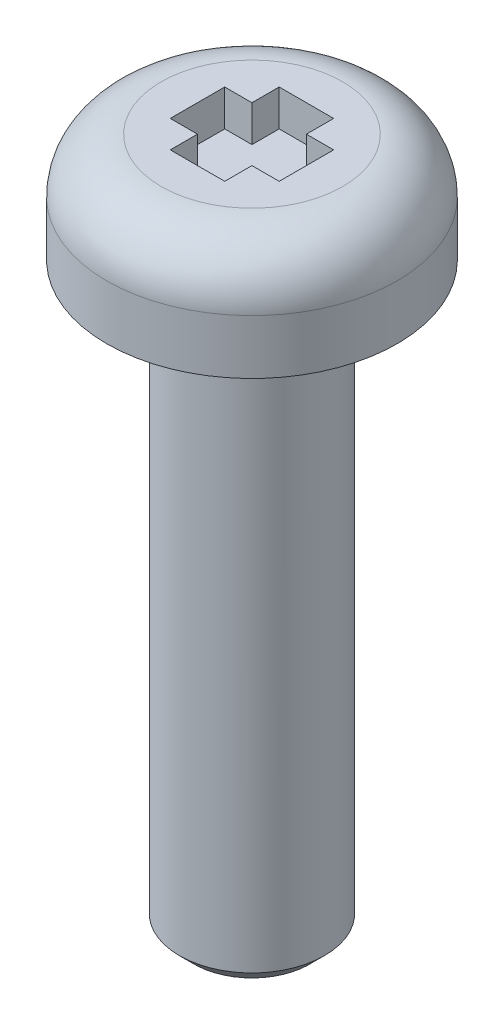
ISO-10303-21;
HEADER;
FILE_DESCRIPTION(('STEP AP214'),'2;1');
FILE_NAME('part.step','',(''),(''),'','','');
FILE_SCHEMA(('AUTOMOTIVE_DESIGN { 1 0 10303 214 1 1 1 1 }'));
ENDSEC;
DATA;
#1=APPLICATION_CONTEXT('core data for automotive mechanical design processes');
#2=APPLICATION_PROTOCOL_DEFINITION('international standard','automotive_design',2000,#1);
#3=PRODUCT_CONTEXT('',#1,'mechanical');
#4=PRODUCT('Part','Part','',(#3));
#5=PRODUCT_RELATED_PRODUCT_CATEGORY('part','',(#4));
#6=PRODUCT_DEFINITION_FORMATION('','',#4);
#7=PRODUCT_DEFINITION_CONTEXT('part definition',#1,'design');
#8=PRODUCT_DEFINITION('design','',#6,#7);
#9=PRODUCT_DEFINITION_SHAPE('','',#8);
#10=(LENGTH_UNIT() NAMED_UNIT(*) SI_UNIT(.MILLI.,.METRE.));
#11=(NAMED_UNIT(*) PLANE_ANGLE_UNIT() SI_UNIT($,.RADIAN.));
#12=(NAMED_UNIT(*) SI_UNIT($,.STERADIAN.) SOLID_ANGLE_UNIT());
#13=UNCERTAINTY_MEASURE_WITH_UNIT(LENGTH_MEASURE(1.E-05),#10,'distance_accuracy_value','');
#14=(GEOMETRIC_REPRESENTATION_CONTEXT(3) GLOBAL_UNCERTAINTY_ASSIGNED_CONTEXT((#13)) GLOBAL_UNIT_ASSIGNED_CONTEXT((#10,
#11,#12)) REPRESENTATION_CONTEXT('',''));
#15=CARTESIAN_POINT('',(0.,0.,0.));
#16=DIRECTION('',(0.,0.,1.));
#17=DIRECTION('',(1.,0.,0.));
#18=AXIS2_PLACEMENT_3D('',#15,#16,#17);
#19=CARTESIAN_POINT('',(4.,0.,0.));
#20=DIRECTION('',(0.,1.,0.));
#21=DIRECTION('',(0.,0.,1.));
#22=AXIS2_PLACEMENT_3D('',#19,#20,#21);
#23=PLANE('',#22);
#24=CARTESIAN_POINT('',(0.,0.,0.));
#25=DIRECTION('',(0.,1.,0.));
#26=DIRECTION('',(0.,0.,1.));
#27=AXIS2_PLACEMENT_3D('',#24,#25,#26);
#28=CIRCLE('',#27,2.4572);
#29=CARTESIAN_POINT('',(0.,0.,2.4572));
#30=VERTEX_POINT('',#29);
#31=EDGE_CURVE('E209',#30,#30,#28,.T.);
#32=ORIENTED_EDGE('',*,*,#31,.T.);
#33=EDGE_LOOP('',(#32));
#34=FACE_BOUND('',#33,.T.);
#35=CARTESIAN_POINT('',(0.,0.,0.));
#36=DIRECTION('',(0.,1.,0.));
#37=DIRECTION('',(0.,0.,1.));
#38=AXIS2_PLACEMENT_3D('',#35,#36,#37);
#39=CIRCLE('',#38,4.);
#40=CARTESIAN_POINT('',(0.,0.,4.));
#41=VERTEX_POINT('',#40);
#42=EDGE_CURVE('E203',#41,#41,#39,.T.);
#43=ORIENTED_EDGE('',*,*,#42,.F.);
#44=EDGE_LOOP('',(#43));
#45=FACE_BOUND('',#44,.T.);
#46=ADVANCED_FACE('F31',(#34,#45),#23,.F.);
#47=CARTESIAN_POINT('',(0.750000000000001,2.,1.5));
#48=DIRECTION('',(1.,0.,0.));
#49=DIRECTION('',(0.,0.,-1.));
#50=AXIS2_PLACEMENT_3D('',#47,#48,#49);
#51=PLANE('',#50);
#52=DIRECTION('',(0.,1.,0.));
#53=VECTOR('',#52,1.);
#54=CARTESIAN_POINT('',(0.75,2.,0.749999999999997));
#55=LINE('',#54,#53);
#56=CARTESIAN_POINT('',(0.750000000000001,2.,0.749999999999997));
#57=VERTEX_POINT('',#56);
#58=CARTESIAN_POINT('',(0.75,3.,0.749999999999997));
#59=VERTEX_POINT('',#58);
#60=EDGE_CURVE('E153',#57,#59,#55,.T.);
#61=ORIENTED_EDGE('',*,*,#60,.F.);
#62=DIRECTION('',(0.,0.,-1.));
#63=VECTOR('',#62,1.);
#64=CARTESIAN_POINT('',(0.750000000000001,2.,1.5));
#65=LINE('',#64,#63);
#66=CARTESIAN_POINT('',(0.750000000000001,2.,1.5));
#67=VERTEX_POINT('',#66);
#68=EDGE_CURVE('E162',#67,#57,#65,.T.);
#69=ORIENTED_EDGE('',*,*,#68,.F.);
#70=DIRECTION('',(0.,1.,0.));
#71=VECTOR('',#70,1.);
#72=CARTESIAN_POINT('',(0.750000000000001,2.,1.5));
#73=LINE('',#72,#71);
#74=CARTESIAN_POINT('',(0.750000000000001,3.,1.5));
#75=VERTEX_POINT('',#74);
#76=EDGE_CURVE('E188',#67,#75,#73,.T.);
#77=ORIENTED_EDGE('',*,*,#76,.T.);
#78=DIRECTION('',(0.,0.,-1.));
#79=VECTOR('',#78,1.);
#80=CARTESIAN_POINT('',(0.750000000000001,3.,1.5));
#81=LINE('',#80,#79);
#82=EDGE_CURVE('E175',#75,#59,#81,.T.);
#83=ORIENTED_EDGE('',*,*,#82,.T.);
#84=EDGE_LOOP('',(#61,#69,#77,#83));
#85=FACE_BOUND('',#84,.T.);
#86=ADVANCED_FACE('F225',(#85),#51,.F.);
#87=CARTESIAN_POINT('',(-0.749999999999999,2.,1.5));
#88=DIRECTION('',(1.,0.,0.));
#89=DIRECTION('',(0.,0.,-1.));
#90=AXIS2_PLACEMENT_3D('',#87,#88,#89);
#91=PLANE('',#90);
#92=DIRECTION('',(0.,0.,-1.));
#93=VECTOR('',#92,1.);
#94=CARTESIAN_POINT('',(-0.749999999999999,2.,1.5));
#95=LINE('',#94,#93);
#96=CARTESIAN_POINT('',(-0.749999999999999,2.,1.5));
#97=VERTEX_POINT('',#96);
#98=CARTESIAN_POINT('',(-0.75,2.,0.75));
#99=VERTEX_POINT('',#98);
#100=EDGE_CURVE('E169',#97,#99,#95,.T.);
#101=ORIENTED_EDGE('',*,*,#100,.T.);
#102=DIRECTION('',(0.,1.,0.));
#103=VECTOR('',#102,1.);
#104=CARTESIAN_POINT('',(-0.75,2.,0.750000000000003));
#105=LINE('',#104,#103);
#106=CARTESIAN_POINT('',(-0.75,3.,0.750000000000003));
#107=VERTEX_POINT('',#106);
#108=EDGE_CURVE('E150',#99,#107,#105,.T.);
#109=ORIENTED_EDGE('',*,*,#108,.T.);
#110=DIRECTION('',(0.,0.,-1.));
#111=VECTOR('',#110,1.);
#112=CARTESIAN_POINT('',(-0.749999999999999,3.,1.5));
#113=LINE('',#112,#111);
#114=CARTESIAN_POINT('',(-0.749999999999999,3.,1.5));
#115=VERTEX_POINT('',#114);
#116=EDGE_CURVE('E182',#115,#107,#113,.T.);
#117=ORIENTED_EDGE('',*,*,#116,.F.);
#118=DIRECTION('',(0.,1.,0.));
#119=VECTOR('',#118,1.);
#120=CARTESIAN_POINT('',(-0.749999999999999,2.,1.5));
#121=LINE('',#120,#119);
#122=EDGE_CURVE('E191',#97,#115,#121,.T.);
#123=ORIENTED_EDGE('',*,*,#122,.F.);
#124=EDGE_LOOP('',(#101,#109,#117,#123));
#125=FACE_BOUND('',#124,.T.);
#126=ADVANCED_FACE('F231',(#125),#91,.T.);
#127=CARTESIAN_POINT('',(0.,11.592517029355,0.));
#128=DIRECTION('',(0.,1.,0.));
#129=DIRECTION('',(0.,0.,1.));
#130=AXIS2_PLACEMENT_3D('',#127,#128,#129);
#131=CYLINDRICAL_SURFACE('',#130,4.);
#132=CARTESIAN_POINT('',(0.,1.5,0.));
#133=DIRECTION('',(0.,1.,0.));
#134=DIRECTION('',(0.,0.,1.));
#135=AXIS2_PLACEMENT_3D('',#132,#133,#134);
#136=CIRCLE('',#135,4.);
#137=CARTESIAN_POINT('',(0.,1.5,4.));
#138=VERTEX_POINT('',#137);
#139=EDGE_CURVE('E200',#138,#138,#136,.T.);
#140=ORIENTED_EDGE('',*,*,#139,.F.);
#141=EDGE_LOOP('',(#140));
#142=FACE_BOUND('',#141,.T.);
#143=ORIENTED_EDGE('',*,*,#42,.T.);
#144=EDGE_LOOP('',(#143));
#145=FACE_BOUND('',#144,.T.);
#146=ADVANCED_FACE('F237',(#142,#145),#131,.T.);
#147=CARTESIAN_POINT('',(0.,1.5,0.));
#148=DIRECTION('',(0.,1.,0.));
#149=DIRECTION('',(0.,0.,1.));
#150=AXIS2_PLACEMENT_3D('',#147,#148,#149);
#151=TOROIDAL_SURFACE('',#150,2.5,1.5);
#152=CARTESIAN_POINT('',(0.,3.,0.));
#153=DIRECTION('',(0.,1.,0.));
#154=DIRECTION('',(0.,0.,1.));
#155=AXIS2_PLACEMENT_3D('',#152,#153,#154);
#156=CIRCLE('',#155,2.5);
#157=CARTESIAN_POINT('',(0.,3.,2.5));
#158=VERTEX_POINT('',#157);
#159=EDGE_CURVE('E190',#158,#158,#156,.T.);
#160=ORIENTED_EDGE('',*,*,#159,.F.);
#161=EDGE_LOOP('',(#160));
#162=FACE_BOUND('',#161,.T.);
#163=ORIENTED_EDGE('',*,*,#139,.T.);
#164=EDGE_LOOP('',(#163));
#165=FACE_BOUND('',#164,.T.);
#166=ADVANCED_FACE('F240',(#162,#165),#151,.T.);
#167=CARTESIAN_POINT('',(0.,3.,0.));
#168=DIRECTION('',(0.,-1.,0.));
#169=DIRECTION('',(0.,0.,-1.));
#170=AXIS2_PLACEMENT_3D('',#167,#168,#169);
#171=PLANE('',#170);
#172=CARTESIAN_POINT('',(0.75,3.,-0.750000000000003));
#173=VERTEX_POINT('',#172);
#174=CARTESIAN_POINT('',(0.75,3.,-1.5));
#175=VERTEX_POINT('',#174);
#176=EDGE_CURVE('E161',#173,#175,#81,.T.);
#177=ORIENTED_EDGE('',*,*,#176,.F.);
#178=DIRECTION('',(-1.,0.,0.));
#179=VECTOR('',#178,1.);
#180=CARTESIAN_POINT('',(1.5,3.,-0.750000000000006));
#181=LINE('',#180,#179);
#182=CARTESIAN_POINT('',(1.5,3.,-0.750000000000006));
#183=VERTEX_POINT('',#182);
#184=EDGE_CURVE('E438',#183,#173,#181,.T.);
#185=ORIENTED_EDGE('',*,*,#184,.F.);
#186=DIRECTION('',(0.,0.,1.));
#187=VECTOR('',#186,1.);
#188=CARTESIAN_POINT('',(1.5,3.,-0.750000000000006));
#189=LINE('',#188,#187);
#190=CARTESIAN_POINT('',(1.5,3.,0.749999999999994));
#191=VERTEX_POINT('',#190);
#192=EDGE_CURVE('E128',#183,#191,#189,.T.);
#193=ORIENTED_EDGE('',*,*,#192,.T.);
#194=DIRECTION('',(-1.,0.,0.));
#195=VECTOR('',#194,1.);
#196=CARTESIAN_POINT('',(1.5,3.,0.749999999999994));
#197=LINE('',#196,#195);
#198=EDGE_CURVE('E423',#191,#59,#197,.T.);
#199=ORIENTED_EDGE('',*,*,#198,.T.);
#200=ORIENTED_EDGE('',*,*,#82,.F.);
#201=DIRECTION('',(-1.,0.,0.));
#202=VECTOR('',#201,1.);
#203=CARTESIAN_POINT('',(0.750000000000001,3.,1.5));
#204=LINE('',#203,#202);
#205=EDGE_CURVE('E185',#75,#115,#204,.T.);
#206=ORIENTED_EDGE('',*,*,#205,.T.);
#207=ORIENTED_EDGE('',*,*,#116,.T.);
#208=CARTESIAN_POINT('',(-1.5,3.,0.750000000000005));
#209=VERTEX_POINT('',#208);
#210=EDGE_CURVE('E429',#107,#209,#197,.T.);
#211=ORIENTED_EDGE('',*,*,#210,.T.);
#212=DIRECTION('',(0.,0.,-1.));
#213=VECTOR('',#212,1.);
#214=CARTESIAN_POINT('',(-1.5,3.,0.750000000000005));
#215=LINE('',#214,#213);
#216=CARTESIAN_POINT('',(-1.5,3.,-0.749999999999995));
#217=VERTEX_POINT('',#216);
#218=EDGE_CURVE('E433',#209,#217,#215,.T.);
#219=ORIENTED_EDGE('',*,*,#218,.T.);
#220=CARTESIAN_POINT('',(-0.75,3.,-0.749999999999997));
#221=VERTEX_POINT('',#220);
#222=EDGE_CURVE('E141',#221,#217,#181,.T.);
#223=ORIENTED_EDGE('',*,*,#222,.F.);
#224=CARTESIAN_POINT('',(-0.75,3.,-1.5));
#225=VERTEX_POINT('',#224);
#226=EDGE_CURVE('E181',#221,#225,#113,.T.);
#227=ORIENTED_EDGE('',*,*,#226,.T.);
#228=DIRECTION('',(1.,0.,0.));
#229=VECTOR('',#228,1.);
#230=CARTESIAN_POINT('',(-0.75,3.,-1.5));
#231=LINE('',#230,#229);
#232=EDGE_CURVE('E178',#225,#175,#231,.T.);
#233=ORIENTED_EDGE('',*,*,#232,.T.);
#234=EDGE_LOOP('',(#177,#185,#193,#199,#200,#206,#207,#211,#219,#223,#227,#233));
#235=FACE_BOUND('',#234,.T.);
#236=ORIENTED_EDGE('',*,*,#159,.T.);
#237=EDGE_LOOP('',(#236));
#238=FACE_BOUND('',#237,.T.);
#239=ADVANCED_FACE('F244',(#235,#238),#171,.F.);
#240=CARTESIAN_POINT('',(0.75,2.,-0.75));
#241=VERTEX_POINT('',#240);
#242=CARTESIAN_POINT('',(0.75,2.,-1.5));
#243=VERTEX_POINT('',#242);
#244=EDGE_CURVE('E166',#241,#243,#65,.T.);
#245=ORIENTED_EDGE('',*,*,#244,.F.);
#246=DIRECTION('',(0.,1.,0.));
#247=VECTOR('',#246,1.);
#248=CARTESIAN_POINT('',(0.75,2.,-0.750000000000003));
#249=LINE('',#248,#247);
#250=EDGE_CURVE('E158',#241,#173,#249,.T.);
#251=ORIENTED_EDGE('',*,*,#250,.T.);
#252=ORIENTED_EDGE('',*,*,#176,.T.);
#253=DIRECTION('',(0.,1.,0.));
#254=VECTOR('',#253,1.);
#255=CARTESIAN_POINT('',(0.75,2.,-1.5));
#256=LINE('',#255,#254);
#257=EDGE_CURVE('E174',#243,#175,#256,.T.);
#258=ORIENTED_EDGE('',*,*,#257,.F.);
#259=EDGE_LOOP('',(#245,#251,#252,#258));
#260=FACE_BOUND('',#259,.T.);
#261=ADVANCED_FACE('F234',(#260),#51,.F.);
#262=CARTESIAN_POINT('',(0.750000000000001,2.,1.5));
#263=DIRECTION('',(0.,0.,-1.));
#264=DIRECTION('',(-1.,0.,0.));
#265=AXIS2_PLACEMENT_3D('',#262,#263,#264);
#266=PLANE('',#265);
#267=ORIENTED_EDGE('',*,*,#205,.F.);
#268=ORIENTED_EDGE('',*,*,#76,.F.);
#269=DIRECTION('',(-1.,0.,0.));
#270=VECTOR('',#269,1.);
#271=CARTESIAN_POINT('',(0.750000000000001,2.,1.5));
#272=LINE('',#271,#270);
#273=EDGE_CURVE('E172',#67,#97,#272,.T.);
#274=ORIENTED_EDGE('',*,*,#273,.T.);
#275=ORIENTED_EDGE('',*,*,#122,.T.);
#276=EDGE_LOOP('',(#267,#268,#274,#275));
#277=FACE_BOUND('',#276,.T.);
#278=ADVANCED_FACE('F250',(#277),#266,.T.);
#279=DIRECTION('',(0.,1.,0.));
#280=VECTOR('',#279,1.);
#281=CARTESIAN_POINT('',(-0.75,2.,-0.749999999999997));
#282=LINE('',#281,#280);
#283=CARTESIAN_POINT('',(-0.75,2.,-0.749999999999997));
#284=VERTEX_POINT('',#283);
#285=EDGE_CURVE('E156',#284,#221,#282,.T.);
#286=ORIENTED_EDGE('',*,*,#285,.F.);
#287=CARTESIAN_POINT('',(-0.75,2.,-1.5));
#288=VERTEX_POINT('',#287);
#289=EDGE_CURVE('E124',#284,#288,#95,.T.);
#290=ORIENTED_EDGE('',*,*,#289,.T.);
#291=DIRECTION('',(0.,1.,0.));
#292=VECTOR('',#291,1.);
#293=CARTESIAN_POINT('',(-0.75,2.,-1.5));
#294=LINE('',#293,#292);
#295=EDGE_CURVE('E193',#288,#225,#294,.T.);
#296=ORIENTED_EDGE('',*,*,#295,.T.);
#297=ORIENTED_EDGE('',*,*,#226,.F.);
#298=EDGE_LOOP('',(#286,#290,#296,#297));
#299=FACE_BOUND('',#298,.T.);
#300=ADVANCED_FACE('F255',(#299),#91,.T.);
#301=CARTESIAN_POINT('',(-0.75,2.,-1.5));
#302=DIRECTION('',(0.,0.,1.));
#303=DIRECTION('',(1.,0.,0.));
#304=AXIS2_PLACEMENT_3D('',#301,#302,#303);
#305=PLANE('',#304);
#306=ORIENTED_EDGE('',*,*,#232,.F.);
#307=ORIENTED_EDGE('',*,*,#295,.F.);
#308=DIRECTION('',(1.,0.,0.));
#309=VECTOR('',#308,1.);
#310=CARTESIAN_POINT('',(-0.75,2.,-1.5));
#311=LINE('',#310,#309);
#312=EDGE_CURVE('E165',#288,#243,#311,.T.);
#313=ORIENTED_EDGE('',*,*,#312,.T.);
#314=ORIENTED_EDGE('',*,*,#257,.T.);
#315=EDGE_LOOP('',(#306,#307,#313,#314));
#316=FACE_BOUND('',#315,.T.);
#317=ADVANCED_FACE('F252',(#316),#305,.T.);
#318=CARTESIAN_POINT('',(0.75,2.,-1.5));
#319=DIRECTION('',(0.,-1.,0.));
#320=DIRECTION('',(0.,0.,-1.));
#321=AXIS2_PLACEMENT_3D('',#318,#319,#320);
#322=PLANE('',#321);
#323=ORIENTED_EDGE('',*,*,#289,.F.);
#324=DIRECTION('',(-1.,0.,0.));
#325=VECTOR('',#324,1.);
#326=CARTESIAN_POINT('',(1.5,2.,-0.750000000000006));
#327=LINE('',#326,#325);
#328=CARTESIAN_POINT('',(-1.5,2.,-0.749999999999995));
#329=VERTEX_POINT('',#328);
#330=EDGE_CURVE('E119',#284,#329,#327,.T.);
#331=ORIENTED_EDGE('',*,*,#330,.T.);
#332=DIRECTION('',(0.,0.,-1.));
#333=VECTOR('',#332,1.);
#334=CARTESIAN_POINT('',(-1.5,2.,0.750000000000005));
#335=LINE('',#334,#333);
#336=CARTESIAN_POINT('',(-1.5,2.,0.750000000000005));
#337=VERTEX_POINT('',#336);
#338=EDGE_CURVE('E122',#337,#329,#335,.T.);
#339=ORIENTED_EDGE('',*,*,#338,.F.);
#340=DIRECTION('',(-1.,0.,0.));
#341=VECTOR('',#340,1.);
#342=CARTESIAN_POINT('',(1.5,2.,0.749999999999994));
#343=LINE('',#342,#341);
#344=EDGE_CURVE('E46',#99,#337,#343,.T.);
#345=ORIENTED_EDGE('',*,*,#344,.F.);
#346=ORIENTED_EDGE('',*,*,#100,.F.);
#347=ORIENTED_EDGE('',*,*,#273,.F.);
#348=ORIENTED_EDGE('',*,*,#68,.T.);
#349=CARTESIAN_POINT('',(1.5,2.,0.749999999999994));
#350=VERTEX_POINT('',#349);
#351=EDGE_CURVE('E146',#350,#57,#343,.T.);
#352=ORIENTED_EDGE('',*,*,#351,.F.);
#353=DIRECTION('',(0.,0.,1.));
#354=VECTOR('',#353,1.);
#355=CARTESIAN_POINT('',(1.5,2.,-0.750000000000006));
#356=LINE('',#355,#354);
#357=CARTESIAN_POINT('',(1.5,2.,-0.750000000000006));
#358=VERTEX_POINT('',#357);
#359=EDGE_CURVE('E142',#358,#350,#356,.T.);
#360=ORIENTED_EDGE('',*,*,#359,.F.);
#361=EDGE_CURVE('E53',#358,#241,#327,.T.);
#362=ORIENTED_EDGE('',*,*,#361,.T.);
#363=ORIENTED_EDGE('',*,*,#244,.T.);
#364=ORIENTED_EDGE('',*,*,#312,.F.);
#365=EDGE_LOOP('',(#323,#331,#339,#345,#346,#347,#348,#352,#360,#362,#363,#364));
#366=FACE_BOUND('',#365,.T.);
#367=ADVANCED_FACE('F121',(#366),#322,.F.);
#368=CARTESIAN_POINT('',(1.5,2.,0.749999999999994));
#369=DIRECTION('',(0.,0.,-1.));
#370=DIRECTION('',(-1.,0.,0.));
#371=AXIS2_PLACEMENT_3D('',#368,#369,#370);
#372=PLANE('',#371);
#373=ORIENTED_EDGE('',*,*,#344,.T.);
#374=DIRECTION('',(0.,1.,0.));
#375=VECTOR('',#374,1.);
#376=CARTESIAN_POINT('',(-1.5,2.,0.750000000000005));
#377=LINE('',#376,#375);
#378=EDGE_CURVE('E137',#337,#209,#377,.T.);
#379=ORIENTED_EDGE('',*,*,#378,.T.);
#380=ORIENTED_EDGE('',*,*,#210,.F.);
#381=ORIENTED_EDGE('',*,*,#108,.F.);
#382=EDGE_LOOP('',(#373,#379,#380,#381));
#383=FACE_BOUND('',#382,.T.);
#384=ADVANCED_FACE('F265',(#383),#372,.T.);
#385=CARTESIAN_POINT('',(1.5,2.,-0.750000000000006));
#386=DIRECTION('',(0.,0.,-1.));
#387=DIRECTION('',(-1.,0.,0.));
#388=AXIS2_PLACEMENT_3D('',#385,#386,#387);
#389=PLANE('',#388);
#390=ORIENTED_EDGE('',*,*,#285,.T.);
#391=ORIENTED_EDGE('',*,*,#222,.T.);
#392=DIRECTION('',(0.,1.,0.));
#393=VECTOR('',#392,1.);
#394=CARTESIAN_POINT('',(-1.5,2.,-0.749999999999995));
#395=LINE('',#394,#393);
#396=EDGE_CURVE('E135',#329,#217,#395,.T.);
#397=ORIENTED_EDGE('',*,*,#396,.F.);
#398=ORIENTED_EDGE('',*,*,#330,.F.);
#399=EDGE_LOOP('',(#390,#391,#397,#398));
#400=FACE_BOUND('',#399,.T.);
#401=ADVANCED_FACE('F139',(#400),#389,.F.);
#402=CARTESIAN_POINT('',(-1.5,2.,0.750000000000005));
#403=DIRECTION('',(1.,0.,0.));
#404=DIRECTION('',(0.,0.,-1.));
#405=AXIS2_PLACEMENT_3D('',#402,#403,#404);
#406=PLANE('',#405);
#407=ORIENTED_EDGE('',*,*,#218,.F.);
#408=ORIENTED_EDGE('',*,*,#378,.F.);
#409=ORIENTED_EDGE('',*,*,#338,.T.);
#410=ORIENTED_EDGE('',*,*,#396,.T.);
#411=EDGE_LOOP('',(#407,#408,#409,#410));
#412=FACE_BOUND('',#411,.T.);
#413=ADVANCED_FACE('F134',(#412),#406,.T.);
#414=ORIENTED_EDGE('',*,*,#361,.F.);
#415=DIRECTION('',(0.,1.,0.));
#416=VECTOR('',#415,1.);
#417=CARTESIAN_POINT('',(1.5,2.,-0.750000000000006));
#418=LINE('',#417,#416);
#419=EDGE_CURVE('E154',#358,#183,#418,.T.);
#420=ORIENTED_EDGE('',*,*,#419,.T.);
#421=ORIENTED_EDGE('',*,*,#184,.T.);
#422=ORIENTED_EDGE('',*,*,#250,.F.);
#423=EDGE_LOOP('',(#414,#420,#421,#422));
#424=FACE_BOUND('',#423,.T.);
#425=ADVANCED_FACE('F268',(#424),#389,.F.);
#426=ORIENTED_EDGE('',*,*,#60,.T.);
#427=ORIENTED_EDGE('',*,*,#198,.F.);
#428=DIRECTION('',(0.,1.,0.));
#429=VECTOR('',#428,1.);
#430=CARTESIAN_POINT('',(1.5,2.,0.749999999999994));
#431=LINE('',#430,#429);
#432=EDGE_CURVE('E144',#350,#191,#431,.T.);
#433=ORIENTED_EDGE('',*,*,#432,.F.);
#434=ORIENTED_EDGE('',*,*,#351,.T.);
#435=EDGE_LOOP('',(#426,#427,#433,#434));
#436=FACE_BOUND('',#435,.T.);
#437=ADVANCED_FACE('F274',(#436),#372,.T.);
#438=CARTESIAN_POINT('',(1.5,2.,-0.750000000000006));
#439=DIRECTION('',(-1.,0.,0.));
#440=DIRECTION('',(0.,0.,1.));
#441=AXIS2_PLACEMENT_3D('',#438,#439,#440);
#442=PLANE('',#441);
#443=ORIENTED_EDGE('',*,*,#192,.F.);
#444=ORIENTED_EDGE('',*,*,#419,.F.);
#445=ORIENTED_EDGE('',*,*,#359,.T.);
#446=ORIENTED_EDGE('',*,*,#432,.T.);
#447=EDGE_LOOP('',(#443,#444,#445,#446));
#448=FACE_BOUND('',#447,.T.);
#449=ADVANCED_FACE('F275',(#448),#442,.T.);
#450=CARTESIAN_POINT('',(0.,-16.,0.));
#451=DIRECTION('',(0.,1.,0.));
#452=DIRECTION('',(0.,0.,1.));
#453=AXIS2_PLACEMENT_3D('',#450,#451,#452);
#454=CYLINDRICAL_SURFACE('',#453,2.);
#455=CARTESIAN_POINT('',(0.,-15.5936,0.));
#456=DIRECTION('',(0.,-1.,0.));
#457=DIRECTION('',(0.,0.,-1.));
#458=AXIS2_PLACEMENT_3D('',#455,#456,#457);
#459=CIRCLE('',#458,2.);
#460=CARTESIAN_POINT('',(0.,-15.5936,-2.));
#461=VERTEX_POINT('',#460);
#462=EDGE_CURVE('E11',#461,#461,#459,.F.);
#463=ORIENTED_EDGE('',*,*,#462,.T.);
#464=EDGE_LOOP('',(#463));
#465=FACE_BOUND('',#464,.T.);
#466=CARTESIAN_POINT('',(0.,-0.4572,0.));
#467=DIRECTION('',(0.,1.,0.));
#468=DIRECTION('',(0.,0.,1.));
#469=AXIS2_PLACEMENT_3D('',#466,#467,#468);
#470=CIRCLE('',#469,2.);
#471=CARTESIAN_POINT('',(0.,-0.4572,2.));
#472=VERTEX_POINT('',#471);
#473=EDGE_CURVE('E206',#472,#472,#470,.F.);
#474=ORIENTED_EDGE('',*,*,#473,.T.);
#475=EDGE_LOOP('',(#474));
#476=FACE_BOUND('',#475,.T.);
#477=ADVANCED_FACE('F278',(#465,#476),#454,.T.);
#478=CARTESIAN_POINT('',(0.,-16.,0.));
#479=DIRECTION('',(0.,-1.,0.));
#480=DIRECTION('',(0.,0.,-1.));
#481=AXIS2_PLACEMENT_3D('',#478,#479,#480);
#482=PLANE('',#481);
#483=CARTESIAN_POINT('',(0.,-16.,0.));
#484=DIRECTION('',(0.,-1.,0.));
#485=DIRECTION('',(0.,0.,-1.));
#486=AXIS2_PLACEMENT_3D('',#483,#484,#485);
#487=CIRCLE('',#486,1.5936);
#488=CARTESIAN_POINT('',(0.,-16.,-1.5936));
#489=VERTEX_POINT('',#488);
#490=EDGE_CURVE('E39',#489,#489,#487,.T.);
#491=ORIENTED_EDGE('',*,*,#490,.T.);
#492=EDGE_LOOP('',(#491));
#493=FACE_BOUND('',#492,.T.);
#494=ADVANCED_FACE('F214',(#493),#482,.T.);
#495=CARTESIAN_POINT('',(0.,-0.4572,0.));
#496=DIRECTION('',(0.,1.,0.));
#497=DIRECTION('',(0.,0.,1.));
#498=AXIS2_PLACEMENT_3D('',#495,#496,#497);
#499=TOROIDAL_SURFACE('',#498,2.4572,0.4572);
#500=ORIENTED_EDGE('',*,*,#31,.F.);
#501=EDGE_LOOP('',(#500));
#502=FACE_BOUND('',#501,.T.);
#503=ORIENTED_EDGE('',*,*,#473,.F.);
#504=EDGE_LOOP('',(#503));
#505=FACE_BOUND('',#504,.T.);
#506=ADVANCED_FACE('F217',(#502,#505),#499,.F.);
#507=CARTESIAN_POINT('',(0.,-16.,0.));
#508=DIRECTION('',(0.,1.,0.));
#509=DIRECTION('',(0.,0.,1.));
#510=AXIS2_PLACEMENT_3D('',#507,#508,#509);
#511=CONICAL_SURFACE('',#510,1.5936,0.785398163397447);
#512=ORIENTED_EDGE('',*,*,#462,.F.);
#513=EDGE_LOOP('',(#512));
#514=FACE_BOUND('',#513,.T.);
#515=ORIENTED_EDGE('',*,*,#490,.F.);
#516=EDGE_LOOP('',(#515));
#517=FACE_BOUND('',#516,.T.);
#518=ADVANCED_FACE('F33',(#514,#517),#511,.T.);
#519=CLOSED_SHELL('',(#46,#86,#126,#146,#166,#239,#261,#278,#300,#317,#367,#384,#401,#413,#425,
#437,#449,#477,#494,#506,#518));
#520=MANIFOLD_SOLID_BREP('B2',#519);
#521=ADVANCED_BREP_SHAPE_REPRESENTATION('',(#18,#520),#14);
#522=SHAPE_DEFINITION_REPRESENTATION(#9,#521);
ENDSEC;
END-ISO-10303-21;
